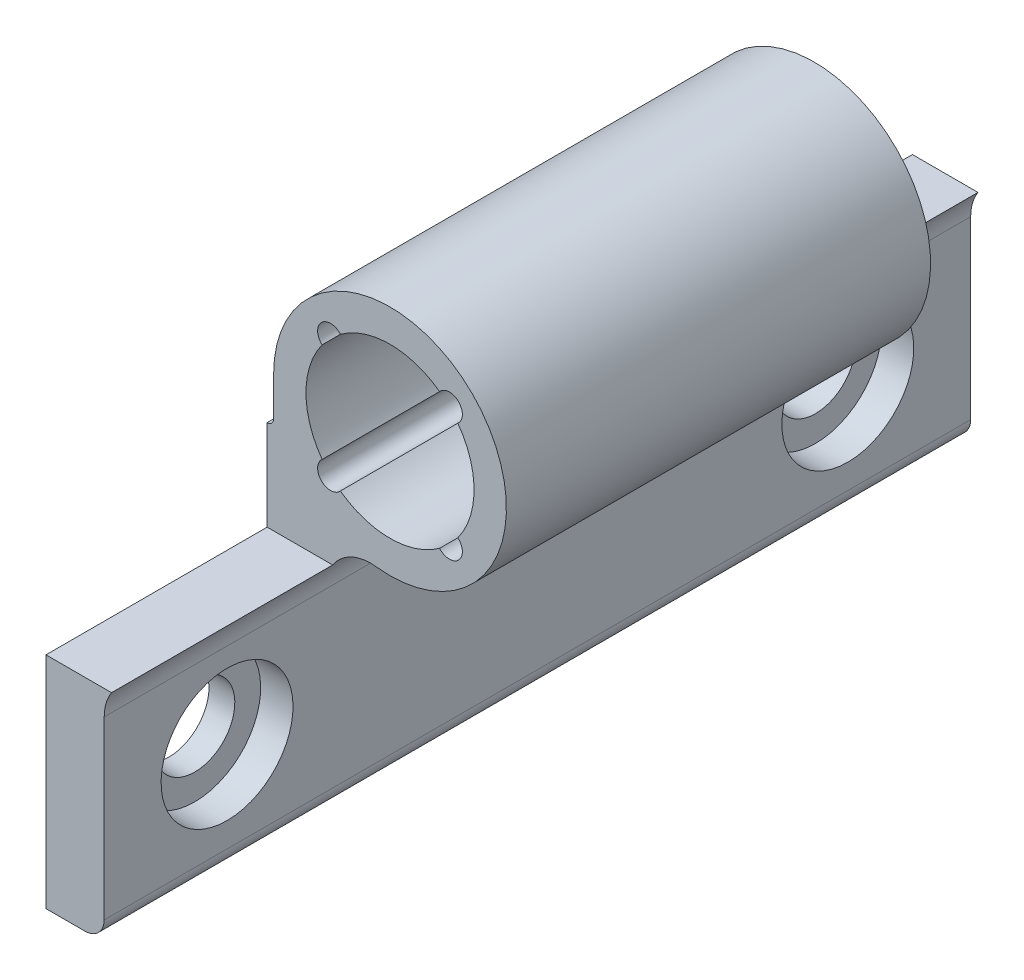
ISO-10303-21;
HEADER;
FILE_DESCRIPTION(('STEP AP214'),'2;1');
FILE_NAME('part.step','',(''),(''),'','','');
FILE_SCHEMA(('AUTOMOTIVE_DESIGN { 1 0 10303 214 1 1 1 1 }'));
ENDSEC;
DATA;
#1=APPLICATION_CONTEXT('core data for automotive mechanical design processes');
#2=APPLICATION_PROTOCOL_DEFINITION('international standard','automotive_design',2000,#1);
#3=PRODUCT_CONTEXT('',#1,'mechanical');
#4=PRODUCT('Part','Part','',(#3));
#5=PRODUCT_RELATED_PRODUCT_CATEGORY('part','',(#4));
#6=PRODUCT_DEFINITION_FORMATION('','',#4);
#7=PRODUCT_DEFINITION_CONTEXT('part definition',#1,'design');
#8=PRODUCT_DEFINITION('design','',#6,#7);
#9=PRODUCT_DEFINITION_SHAPE('','',#8);
#10=(LENGTH_UNIT() NAMED_UNIT(*) SI_UNIT(.MILLI.,.METRE.));
#11=(NAMED_UNIT(*) PLANE_ANGLE_UNIT() SI_UNIT($,.RADIAN.));
#12=(NAMED_UNIT(*) SI_UNIT($,.STERADIAN.) SOLID_ANGLE_UNIT());
#13=UNCERTAINTY_MEASURE_WITH_UNIT(LENGTH_MEASURE(1.E-05),#10,'distance_accuracy_value','');
#14=(GEOMETRIC_REPRESENTATION_CONTEXT(3) GLOBAL_UNCERTAINTY_ASSIGNED_CONTEXT((#13)) GLOBAL_UNIT_ASSIGNED_CONTEXT((#10,
#11,#12)) REPRESENTATION_CONTEXT('',''));
#15=CARTESIAN_POINT('',(0.,0.,0.));
#16=DIRECTION('',(0.,0.,1.));
#17=DIRECTION('',(1.,0.,0.));
#18=AXIS2_PLACEMENT_3D('',#15,#16,#17);
#19=CARTESIAN_POINT('',(-7.5,-22.1,-57.5));
#20=DIRECTION('',(-1.,0.,0.));
#21=DIRECTION('',(0.,-1.,0.));
#22=AXIS2_PLACEMENT_3D('',#19,#20,#21);
#23=PLANE('',#22);
#24=CARTESIAN_POINT('',(-7.5,-19.,-57.5));
#25=DIRECTION('',(-1.,0.,0.));
#26=DIRECTION('',(0.,-1.,0.));
#27=AXIS2_PLACEMENT_3D('',#24,#25,#26);
#28=CIRCLE('',#27,3.10000000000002);
#29=CARTESIAN_POINT('',(-7.5,-22.1,-57.5));
#30=VERTEX_POINT('',#29);
#31=EDGE_CURVE('E19',#30,#30,#28,.T.);
#32=ORIENTED_EDGE('',*,*,#31,.T.);
#33=EDGE_LOOP('',(#32));
#34=FACE_BOUND('',#33,.T.);
#35=CARTESIAN_POINT('',(-7.5,-19.,-57.5));
#36=DIRECTION('',(-1.,0.,0.));
#37=DIRECTION('',(0.,-1.,0.));
#38=AXIS2_PLACEMENT_3D('',#35,#36,#37);
#39=CIRCLE('',#38,5.10000000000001);
#40=CARTESIAN_POINT('',(-7.5,-24.1,-57.5));
#41=VERTEX_POINT('',#40);
#42=EDGE_CURVE('E263',#41,#41,#39,.F.);
#43=ORIENTED_EDGE('',*,*,#42,.T.);
#44=EDGE_LOOP('',(#43));
#45=FACE_BOUND('',#44,.T.);
#46=ADVANCED_FACE('F16',(#34,#45),#23,.F.);
#47=CARTESIAN_POINT('',(-7.5,-22.1,-9.5));
#48=DIRECTION('',(-1.,0.,0.));
#49=DIRECTION('',(0.,-1.,0.));
#50=AXIS2_PLACEMENT_3D('',#47,#48,#49);
#51=PLANE('',#50);
#52=CARTESIAN_POINT('',(-7.5,-19.,-9.5));
#53=DIRECTION('',(-1.,0.,0.));
#54=DIRECTION('',(0.,-1.,0.));
#55=AXIS2_PLACEMENT_3D('',#52,#53,#54);
#56=CIRCLE('',#55,3.10000000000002);
#57=CARTESIAN_POINT('',(-7.5,-22.1,-9.5));
#58=VERTEX_POINT('',#57);
#59=EDGE_CURVE('E265',#58,#58,#56,.T.);
#60=ORIENTED_EDGE('',*,*,#59,.T.);
#61=EDGE_LOOP('',(#60));
#62=FACE_BOUND('',#61,.T.);
#63=CARTESIAN_POINT('',(-7.5,-19.,-9.5));
#64=DIRECTION('',(-1.,0.,0.));
#65=DIRECTION('',(0.,-1.,0.));
#66=AXIS2_PLACEMENT_3D('',#63,#64,#65);
#67=CIRCLE('',#66,5.10000000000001);
#68=CARTESIAN_POINT('',(-7.5,-24.1,-9.5));
#69=VERTEX_POINT('',#68);
#70=EDGE_CURVE('E260',#69,#69,#67,.F.);
#71=ORIENTED_EDGE('',*,*,#70,.T.);
#72=EDGE_LOOP('',(#71));
#73=FACE_BOUND('',#72,.T.);
#74=ADVANCED_FACE('F278',(#62,#73),#51,.F.);
#75=CARTESIAN_POINT('',(-5.,-19.,-57.5));
#76=DIRECTION('',(-1.,0.,0.));
#77=DIRECTION('',(0.,-1.,0.));
#78=AXIS2_PLACEMENT_3D('',#75,#76,#77);
#79=CYLINDRICAL_SURFACE('',#78,3.10000000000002);
#80=ORIENTED_EDGE('',*,*,#31,.F.);
#81=EDGE_LOOP('',(#80));
#82=FACE_BOUND('',#81,.T.);
#83=CARTESIAN_POINT('',(-9.5,-19.,-57.5));
#84=DIRECTION('',(-1.,0.,0.));
#85=DIRECTION('',(0.,-1.,0.));
#86=AXIS2_PLACEMENT_3D('',#83,#84,#85);
#87=CIRCLE('',#86,3.10000000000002);
#88=CARTESIAN_POINT('',(-9.5,-22.1,-57.5));
#89=VERTEX_POINT('',#88);
#90=EDGE_CURVE('E253',#89,#89,#87,.F.);
#91=ORIENTED_EDGE('',*,*,#90,.F.);
#92=EDGE_LOOP('',(#91));
#93=FACE_BOUND('',#92,.T.);
#94=ADVANCED_FACE('F274',(#82,#93),#79,.F.);
#95=CARTESIAN_POINT('',(-5.,-19.,-9.5));
#96=DIRECTION('',(-1.,0.,0.));
#97=DIRECTION('',(0.,-1.,0.));
#98=AXIS2_PLACEMENT_3D('',#95,#96,#97);
#99=CYLINDRICAL_SURFACE('',#98,3.10000000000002);
#100=ORIENTED_EDGE('',*,*,#59,.F.);
#101=EDGE_LOOP('',(#100));
#102=FACE_BOUND('',#101,.T.);
#103=CARTESIAN_POINT('',(-9.5,-19.,-9.5));
#104=DIRECTION('',(-1.,0.,0.));
#105=DIRECTION('',(0.,-1.,0.));
#106=AXIS2_PLACEMENT_3D('',#103,#104,#105);
#107=CIRCLE('',#106,3.10000000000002);
#108=CARTESIAN_POINT('',(-9.5,-22.1,-9.5));
#109=VERTEX_POINT('',#108);
#110=EDGE_CURVE('E249',#109,#109,#107,.F.);
#111=ORIENTED_EDGE('',*,*,#110,.F.);
#112=EDGE_LOOP('',(#111));
#113=FACE_BOUND('',#112,.T.);
#114=ADVANCED_FACE('F277',(#102,#113),#99,.F.);
#115=CARTESIAN_POINT('',(-5.,-19.,-57.5));
#116=DIRECTION('',(-1.,0.,0.));
#117=DIRECTION('',(0.,-1.,0.));
#118=AXIS2_PLACEMENT_3D('',#115,#116,#117);
#119=CYLINDRICAL_SURFACE('',#118,5.10000000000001);
#120=ORIENTED_EDGE('',*,*,#42,.F.);
#121=EDGE_LOOP('',(#120));
#122=FACE_BOUND('',#121,.T.);
#123=CARTESIAN_POINT('',(-5.,-19.,-57.5));
#124=DIRECTION('',(-1.,0.,0.));
#125=DIRECTION('',(0.,-1.,0.));
#126=AXIS2_PLACEMENT_3D('',#123,#124,#125);
#127=CIRCLE('',#126,5.10000000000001);
#128=CARTESIAN_POINT('',(-5.,-24.1,-57.5));
#129=VERTEX_POINT('',#128);
#130=EDGE_CURVE('E241',#129,#129,#127,.T.);
#131=ORIENTED_EDGE('',*,*,#130,.F.);
#132=EDGE_LOOP('',(#131));
#133=FACE_BOUND('',#132,.T.);
#134=ADVANCED_FACE('F477',(#122,#133),#119,.F.);
#135=CARTESIAN_POINT('',(-5.,-19.,-9.5));
#136=DIRECTION('',(-1.,0.,0.));
#137=DIRECTION('',(0.,-1.,0.));
#138=AXIS2_PLACEMENT_3D('',#135,#136,#137);
#139=CYLINDRICAL_SURFACE('',#138,5.10000000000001);
#140=ORIENTED_EDGE('',*,*,#70,.F.);
#141=EDGE_LOOP('',(#140));
#142=FACE_BOUND('',#141,.T.);
#143=CARTESIAN_POINT('',(-5.,-19.,-9.5));
#144=DIRECTION('',(-1.,0.,0.));
#145=DIRECTION('',(0.,-1.,0.));
#146=AXIS2_PLACEMENT_3D('',#143,#144,#145);
#147=CIRCLE('',#146,5.10000000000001);
#148=CARTESIAN_POINT('',(-5.,-24.1,-9.5));
#149=VERTEX_POINT('',#148);
#150=EDGE_CURVE('E238',#149,#149,#147,.T.);
#151=ORIENTED_EDGE('',*,*,#150,.F.);
#152=EDGE_LOOP('',(#151));
#153=FACE_BOUND('',#152,.T.);
#154=ADVANCED_FACE('F473',(#142,#153),#139,.F.);
#155=CARTESIAN_POINT('',(-6.5,-26.,-17.1));
#156=DIRECTION('',(0.,0.,-1.));
#157=DIRECTION('',(-1.,0.,0.));
#158=AXIS2_PLACEMENT_3D('',#155,#156,#157);
#159=CYLINDRICAL_SURFACE('',#158,1.5);
#160=CARTESIAN_POINT('',(-6.5,-26.,-67.));
#161=DIRECTION('',(0.,0.,-1.));
#162=DIRECTION('',(-1.,0.,0.));
#163=AXIS2_PLACEMENT_3D('',#160,#161,#162);
#164=CIRCLE('',#163,1.5);
#165=CARTESIAN_POINT('',(-6.5,-27.5,-67.));
#166=VERTEX_POINT('',#165);
#167=CARTESIAN_POINT('',(-5.,-26.,-67.));
#168=VERTEX_POINT('',#167);
#169=EDGE_CURVE('E245',#166,#168,#164,.F.);
#170=ORIENTED_EDGE('',*,*,#169,.T.);
#171=DIRECTION('',(0.,0.,-1.));
#172=VECTOR('',#171,1.);
#173=CARTESIAN_POINT('',(-5.,-26.,-17.1));
#174=LINE('',#173,#172);
#175=CARTESIAN_POINT('',(-5.,-26.,0.));
#176=VERTEX_POINT('',#175);
#177=EDGE_CURVE('E299',#176,#168,#174,.T.);
#178=ORIENTED_EDGE('',*,*,#177,.F.);
#179=CARTESIAN_POINT('',(-6.5,-26.,0.));
#180=DIRECTION('',(0.,0.,-1.));
#181=DIRECTION('',(-1.,0.,0.));
#182=AXIS2_PLACEMENT_3D('',#179,#180,#181);
#183=CIRCLE('',#182,1.5);
#184=CARTESIAN_POINT('',(-6.5,-27.5,0.));
#185=VERTEX_POINT('',#184);
#186=EDGE_CURVE('E234',#185,#176,#183,.F.);
#187=ORIENTED_EDGE('',*,*,#186,.F.);
#188=DIRECTION('',(0.,0.,1.));
#189=VECTOR('',#188,1.);
#190=CARTESIAN_POINT('',(-6.5,-27.5,-17.1));
#191=LINE('',#190,#189);
#192=EDGE_CURVE('E259',#166,#185,#191,.T.);
#193=ORIENTED_EDGE('',*,*,#192,.F.);
#194=EDGE_LOOP('',(#170,#178,#187,#193));
#195=FACE_BOUND('',#194,.T.);
#196=ADVANCED_FACE('F470',(#195),#159,.T.);
#197=CARTESIAN_POINT('',(-9.5,-27.5,-17.1));
#198=DIRECTION('',(0.,-1.,0.));
#199=DIRECTION('',(1.,0.,0.));
#200=AXIS2_PLACEMENT_3D('',#197,#198,#199);
#201=PLANE('',#200);
#202=DIRECTION('',(1.,0.,0.));
#203=VECTOR('',#202,1.);
#204=CARTESIAN_POINT('',(-6.5,-27.5,-67.));
#205=LINE('',#204,#203);
#206=CARTESIAN_POINT('',(-9.5,-27.5,-67.));
#207=VERTEX_POINT('',#206);
#208=EDGE_CURVE('E248',#207,#166,#205,.T.);
#209=ORIENTED_EDGE('',*,*,#208,.T.);
#210=ORIENTED_EDGE('',*,*,#192,.T.);
#211=DIRECTION('',(1.,0.,0.));
#212=VECTOR('',#211,1.);
#213=CARTESIAN_POINT('',(-6.5,-27.5,0.));
#214=LINE('',#213,#212);
#215=CARTESIAN_POINT('',(-9.5,-27.5,0.));
#216=VERTEX_POINT('',#215);
#217=EDGE_CURVE('E233',#216,#185,#214,.T.);
#218=ORIENTED_EDGE('',*,*,#217,.F.);
#219=DIRECTION('',(0.,0.,1.));
#220=VECTOR('',#219,1.);
#221=CARTESIAN_POINT('',(-9.5,-27.5,-17.1));
#222=LINE('',#221,#220);
#223=EDGE_CURVE('E256',#207,#216,#222,.T.);
#224=ORIENTED_EDGE('',*,*,#223,.F.);
#225=EDGE_LOOP('',(#209,#210,#218,#224));
#226=FACE_BOUND('',#225,.T.);
#227=ADVANCED_FACE('F467',(#226),#201,.T.);
#228=CARTESIAN_POINT('',(-9.5,-3.,-49.9));
#229=DIRECTION('',(0.,0.,-1.));
#230=DIRECTION('',(-1.,0.,0.));
#231=AXIS2_PLACEMENT_3D('',#228,#229,#230);
#232=CYLINDRICAL_SURFACE('',#231,0.500000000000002);
#233=DIRECTION('',(0.,0.,-1.));
#234=VECTOR('',#233,1.);
#235=CARTESIAN_POINT('',(-9.,-3.,-49.9));
#236=LINE('',#235,#234);
#237=CARTESIAN_POINT('',(-9.,-3.,-17.1));
#238=VERTEX_POINT('',#237);
#239=CARTESIAN_POINT('',(-9.,-3.,-49.9));
#240=VERTEX_POINT('',#239);
#241=EDGE_CURVE('E214',#238,#240,#236,.T.);
#242=ORIENTED_EDGE('',*,*,#241,.T.);
#243=CARTESIAN_POINT('',(-9.5,-3.,-49.9));
#244=DIRECTION('',(0.,0.,-1.));
#245=DIRECTION('',(-1.,0.,0.));
#246=AXIS2_PLACEMENT_3D('',#243,#244,#245);
#247=CIRCLE('',#246,0.500000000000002);
#248=CARTESIAN_POINT('',(-9.5,-3.5,-49.9));
#249=VERTEX_POINT('',#248);
#250=EDGE_CURVE('E230',#240,#249,#247,.T.);
#251=ORIENTED_EDGE('',*,*,#250,.T.);
#252=DIRECTION('',(0.,0.,1.));
#253=VECTOR('',#252,1.);
#254=CARTESIAN_POINT('',(-9.5,-3.5,-17.1));
#255=LINE('',#254,#253);
#256=CARTESIAN_POINT('',(-9.5,-3.5,-17.1));
#257=VERTEX_POINT('',#256);
#258=EDGE_CURVE('E258',#257,#249,#255,.F.);
#259=ORIENTED_EDGE('',*,*,#258,.F.);
#260=CARTESIAN_POINT('',(-9.5,-3.,-17.1));
#261=DIRECTION('',(0.,0.,-1.));
#262=DIRECTION('',(-1.,0.,0.));
#263=AXIS2_PLACEMENT_3D('',#260,#261,#262);
#264=CIRCLE('',#263,0.500000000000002);
#265=EDGE_CURVE('E120',#238,#257,#264,.T.);
#266=ORIENTED_EDGE('',*,*,#265,.F.);
#267=EDGE_LOOP('',(#242,#251,#259,#266));
#268=FACE_BOUND('',#267,.T.);
#269=ADVANCED_FACE('F285',(#268),#232,.F.);
#270=CARTESIAN_POINT('',(-9.5,-10.5,-17.1));
#271=DIRECTION('',(-1.,0.,0.));
#272=DIRECTION('',(0.,-1.,0.));
#273=AXIS2_PLACEMENT_3D('',#270,#271,#272);
#274=PLANE('',#273);
#275=ORIENTED_EDGE('',*,*,#110,.T.);
#276=EDGE_LOOP('',(#275));
#277=FACE_BOUND('',#276,.T.);
#278=ORIENTED_EDGE('',*,*,#90,.T.);
#279=EDGE_LOOP('',(#278));
#280=FACE_BOUND('',#279,.T.);
#281=DIRECTION('',(0.,1.,0.));
#282=VECTOR('',#281,1.);
#283=CARTESIAN_POINT('',(-9.5,-26.,-67.));
#284=LINE('',#283,#282);
#285=CARTESIAN_POINT('',(-9.5,-10.5,-67.));
#286=VERTEX_POINT('',#285);
#287=EDGE_CURVE('E291',#286,#207,#284,.F.);
#288=ORIENTED_EDGE('',*,*,#287,.T.);
#289=ORIENTED_EDGE('',*,*,#223,.T.);
#290=DIRECTION('',(0.,1.,0.));
#291=VECTOR('',#290,1.);
#292=CARTESIAN_POINT('',(-9.5,-26.,0.));
#293=LINE('',#292,#291);
#294=CARTESIAN_POINT('',(-9.5,-10.5,0.));
#295=VERTEX_POINT('',#294);
#296=EDGE_CURVE('E341',#295,#216,#293,.F.);
#297=ORIENTED_EDGE('',*,*,#296,.F.);
#298=DIRECTION('',(0.,0.,1.));
#299=VECTOR('',#298,1.);
#300=CARTESIAN_POINT('',(-9.5,-10.5,-17.1));
#301=LINE('',#300,#299);
#302=CARTESIAN_POINT('',(-9.5,-10.5,-17.1));
#303=VERTEX_POINT('',#302);
#304=EDGE_CURVE('E128',#303,#295,#301,.T.);
#305=ORIENTED_EDGE('',*,*,#304,.F.);
#306=DIRECTION('',(0.,1.,0.));
#307=VECTOR('',#306,1.);
#308=CARTESIAN_POINT('',(-9.5,0.,-17.1));
#309=LINE('',#308,#307);
#310=EDGE_CURVE('E174',#257,#303,#309,.F.);
#311=ORIENTED_EDGE('',*,*,#310,.F.);
#312=ORIENTED_EDGE('',*,*,#258,.T.);
#313=DIRECTION('',(0.,1.,0.));
#314=VECTOR('',#313,1.);
#315=CARTESIAN_POINT('',(-9.5,0.,-49.9));
#316=LINE('',#315,#314);
#317=CARTESIAN_POINT('',(-9.5,-10.5,-49.9));
#318=VERTEX_POINT('',#317);
#319=EDGE_CURVE('E232',#249,#318,#316,.F.);
#320=ORIENTED_EDGE('',*,*,#319,.T.);
#321=DIRECTION('',(0.,0.,1.));
#322=VECTOR('',#321,1.);
#323=CARTESIAN_POINT('',(-9.5,-10.5,-67.));
#324=LINE('',#323,#322);
#325=EDGE_CURVE('E295',#318,#286,#324,.F.);
#326=ORIENTED_EDGE('',*,*,#325,.T.);
#327=EDGE_LOOP('',(#288,#289,#297,#305,#311,#312,#320,#326));
#328=FACE_BOUND('',#327,.T.);
#329=ADVANCED_FACE('F282',(#277,#280,#328),#274,.T.);
#330=CARTESIAN_POINT('',(-4.59619407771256,-4.59619407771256,-17.1));
#331=DIRECTION('',(0.,0.,-1.));
#332=DIRECTION('',(-1.,0.,0.));
#333=AXIS2_PLACEMENT_3D('',#330,#331,#332);
#334=CYLINDRICAL_SURFACE('',#333,1.00000000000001);
#335=DIRECTION('',(0.,0.,-1.));
#336=VECTOR('',#335,1.);
#337=CARTESIAN_POINT('',(-5.24681289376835,-3.83678960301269,-17.1));
#338=LINE('',#337,#336);
#339=CARTESIAN_POINT('',(-5.24681289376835,-3.83678960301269,-49.9));
#340=VERTEX_POINT('',#339);
#341=CARTESIAN_POINT('',(-5.24681289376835,-3.83678960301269,-17.1));
#342=VERTEX_POINT('',#341);
#343=EDGE_CURVE('E252',#340,#342,#338,.F.);
#344=ORIENTED_EDGE('',*,*,#343,.T.);
#345=CARTESIAN_POINT('',(-4.59619407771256,-4.59619407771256,-17.1));
#346=DIRECTION('',(0.,0.,-1.));
#347=DIRECTION('',(-1.,0.,0.));
#348=AXIS2_PLACEMENT_3D('',#345,#346,#347);
#349=CIRCLE('',#348,1.00000000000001);
#350=CARTESIAN_POINT('',(-3.83678960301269,-5.24681289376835,-17.1));
#351=VERTEX_POINT('',#350);
#352=EDGE_CURVE('E208',#351,#342,#349,.T.);
#353=ORIENTED_EDGE('',*,*,#352,.F.);
#354=DIRECTION('',(0.,0.,-1.));
#355=VECTOR('',#354,1.);
#356=CARTESIAN_POINT('',(-3.83678960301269,-5.24681289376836,-17.1));
#357=LINE('',#356,#355);
#358=CARTESIAN_POINT('',(-3.83678960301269,-5.24681289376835,-49.9));
#359=VERTEX_POINT('',#358);
#360=EDGE_CURVE('E319',#351,#359,#357,.T.);
#361=ORIENTED_EDGE('',*,*,#360,.T.);
#362=CARTESIAN_POINT('',(-4.59619407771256,-4.59619407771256,-49.9));
#363=DIRECTION('',(0.,0.,-1.));
#364=DIRECTION('',(-1.,0.,0.));
#365=AXIS2_PLACEMENT_3D('',#362,#363,#364);
#366=CIRCLE('',#365,1.00000000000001);
#367=EDGE_CURVE('E215',#359,#340,#366,.T.);
#368=ORIENTED_EDGE('',*,*,#367,.T.);
#369=EDGE_LOOP('',(#344,#353,#361,#368));
#370=FACE_BOUND('',#369,.T.);
#371=ADVANCED_FACE('F284',(#370),#334,.F.);
#372=CARTESIAN_POINT('',(0.,0.,-17.1));
#373=DIRECTION('',(0.,0.,-1.));
#374=DIRECTION('',(-1.,0.,0.));
#375=AXIS2_PLACEMENT_3D('',#372,#373,#374);
#376=CYLINDRICAL_SURFACE('',#375,6.50000000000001);
#377=ORIENTED_EDGE('',*,*,#343,.F.);
#378=CARTESIAN_POINT('',(0.,0.,-49.9));
#379=DIRECTION('',(0.,0.,-1.));
#380=DIRECTION('',(-1.,0.,0.));
#381=AXIS2_PLACEMENT_3D('',#378,#379,#380);
#382=CIRCLE('',#381,6.50000000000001);
#383=CARTESIAN_POINT('',(-5.24681289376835,3.83678960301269,-49.9));
#384=VERTEX_POINT('',#383);
#385=EDGE_CURVE('E211',#340,#384,#382,.T.);
#386=ORIENTED_EDGE('',*,*,#385,.T.);
#387=DIRECTION('',(0.,0.,-1.));
#388=VECTOR('',#387,1.);
#389=CARTESIAN_POINT('',(-5.24681289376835,3.83678960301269,-17.1));
#390=LINE('',#389,#388);
#391=CARTESIAN_POINT('',(-5.24681289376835,3.83678960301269,-17.1));
#392=VERTEX_POINT('',#391);
#393=EDGE_CURVE('E329',#384,#392,#390,.F.);
#394=ORIENTED_EDGE('',*,*,#393,.T.);
#395=CARTESIAN_POINT('',(0.,0.,-17.1));
#396=DIRECTION('',(0.,0.,-1.));
#397=DIRECTION('',(-1.,0.,0.));
#398=AXIS2_PLACEMENT_3D('',#395,#396,#397);
#399=CIRCLE('',#398,6.50000000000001);
#400=EDGE_CURVE('E205',#342,#392,#399,.T.);
#401=ORIENTED_EDGE('',*,*,#400,.F.);
#402=EDGE_LOOP('',(#377,#386,#394,#401));
#403=FACE_BOUND('',#402,.T.);
#404=ADVANCED_FACE('F457',(#403),#376,.F.);
#405=CARTESIAN_POINT('',(-4.59619407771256,4.59619407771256,-17.1));
#406=DIRECTION('',(0.,0.,-1.));
#407=DIRECTION('',(-1.,0.,0.));
#408=AXIS2_PLACEMENT_3D('',#405,#406,#407);
#409=CYLINDRICAL_SURFACE('',#408,1.00000000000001);
#410=DIRECTION('',(0.,0.,-1.));
#411=VECTOR('',#410,1.);
#412=CARTESIAN_POINT('',(-3.83678960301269,5.24681289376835,-17.1));
#413=LINE('',#412,#411);
#414=CARTESIAN_POINT('',(-3.83678960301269,5.24681289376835,-49.9));
#415=VERTEX_POINT('',#414);
#416=CARTESIAN_POINT('',(-3.83678960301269,5.24681289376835,-17.1));
#417=VERTEX_POINT('',#416);
#418=EDGE_CURVE('E327',#415,#417,#413,.F.);
#419=ORIENTED_EDGE('',*,*,#418,.T.);
#420=CARTESIAN_POINT('',(-4.59619407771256,4.59619407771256,-17.1));
#421=DIRECTION('',(0.,0.,-1.));
#422=DIRECTION('',(-1.,0.,0.));
#423=AXIS2_PLACEMENT_3D('',#420,#421,#422);
#424=CIRCLE('',#423,1.00000000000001);
#425=EDGE_CURVE('E202',#392,#417,#424,.T.);
#426=ORIENTED_EDGE('',*,*,#425,.F.);
#427=ORIENTED_EDGE('',*,*,#393,.F.);
#428=CARTESIAN_POINT('',(-4.59619407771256,4.59619407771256,-49.9));
#429=DIRECTION('',(0.,0.,-1.));
#430=DIRECTION('',(-1.,0.,0.));
#431=AXIS2_PLACEMENT_3D('',#428,#429,#430);
#432=CIRCLE('',#431,1.00000000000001);
#433=EDGE_CURVE('E228',#384,#415,#432,.T.);
#434=ORIENTED_EDGE('',*,*,#433,.T.);
#435=EDGE_LOOP('',(#419,#426,#427,#434));
#436=FACE_BOUND('',#435,.T.);
#437=ADVANCED_FACE('F453',(#436),#409,.F.);
#438=CARTESIAN_POINT('',(0.,0.,-17.1));
#439=DIRECTION('',(0.,0.,-1.));
#440=DIRECTION('',(-1.,0.,0.));
#441=AXIS2_PLACEMENT_3D('',#438,#439,#440);
#442=CYLINDRICAL_SURFACE('',#441,6.50000000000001);
#443=DIRECTION('',(0.,0.,-1.));
#444=VECTOR('',#443,1.);
#445=CARTESIAN_POINT('',(3.83678960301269,5.24681289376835,-17.1));
#446=LINE('',#445,#444);
#447=CARTESIAN_POINT('',(3.83678960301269,5.24681289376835,-49.9));
#448=VERTEX_POINT('',#447);
#449=CARTESIAN_POINT('',(3.83678960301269,5.24681289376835,-17.1));
#450=VERTEX_POINT('',#449);
#451=EDGE_CURVE('E325',#448,#450,#446,.F.);
#452=ORIENTED_EDGE('',*,*,#451,.T.);
#453=CARTESIAN_POINT('',(0.,0.,-17.1));
#454=DIRECTION('',(0.,0.,-1.));
#455=DIRECTION('',(-1.,0.,0.));
#456=AXIS2_PLACEMENT_3D('',#453,#454,#455);
#457=CIRCLE('',#456,6.50000000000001);
#458=EDGE_CURVE('E199',#417,#450,#457,.T.);
#459=ORIENTED_EDGE('',*,*,#458,.F.);
#460=ORIENTED_EDGE('',*,*,#418,.F.);
#461=CARTESIAN_POINT('',(0.,0.,-49.9));
#462=DIRECTION('',(0.,0.,-1.));
#463=DIRECTION('',(-1.,0.,0.));
#464=AXIS2_PLACEMENT_3D('',#461,#462,#463);
#465=CIRCLE('',#464,6.50000000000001);
#466=EDGE_CURVE('E226',#415,#448,#465,.T.);
#467=ORIENTED_EDGE('',*,*,#466,.T.);
#468=EDGE_LOOP('',(#452,#459,#460,#467));
#469=FACE_BOUND('',#468,.T.);
#470=ADVANCED_FACE('F449',(#469),#442,.F.);
#471=CARTESIAN_POINT('',(4.59619407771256,4.59619407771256,-17.1));
#472=DIRECTION('',(0.,0.,-1.));
#473=DIRECTION('',(-1.,0.,0.));
#474=AXIS2_PLACEMENT_3D('',#471,#472,#473);
#475=CYLINDRICAL_SURFACE('',#474,1.00000000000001);
#476=DIRECTION('',(0.,0.,-1.));
#477=VECTOR('',#476,1.);
#478=CARTESIAN_POINT('',(5.24681289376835,3.83678960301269,-17.1));
#479=LINE('',#478,#477);
#480=CARTESIAN_POINT('',(5.24681289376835,3.83678960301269,-49.9));
#481=VERTEX_POINT('',#480);
#482=CARTESIAN_POINT('',(5.24681289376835,3.83678960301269,-17.1));
#483=VERTEX_POINT('',#482);
#484=EDGE_CURVE('E323',#481,#483,#479,.F.);
#485=ORIENTED_EDGE('',*,*,#484,.T.);
#486=CARTESIAN_POINT('',(4.59619407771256,4.59619407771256,-17.1));
#487=DIRECTION('',(0.,0.,-1.));
#488=DIRECTION('',(-1.,0.,0.));
#489=AXIS2_PLACEMENT_3D('',#486,#487,#488);
#490=CIRCLE('',#489,1.00000000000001);
#491=EDGE_CURVE('E196',#450,#483,#490,.T.);
#492=ORIENTED_EDGE('',*,*,#491,.F.);
#493=ORIENTED_EDGE('',*,*,#451,.F.);
#494=CARTESIAN_POINT('',(4.59619407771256,4.59619407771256,-49.9));
#495=DIRECTION('',(0.,0.,-1.));
#496=DIRECTION('',(-1.,0.,0.));
#497=AXIS2_PLACEMENT_3D('',#494,#495,#496);
#498=CIRCLE('',#497,1.00000000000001);
#499=EDGE_CURVE('E224',#448,#481,#498,.T.);
#500=ORIENTED_EDGE('',*,*,#499,.T.);
#501=EDGE_LOOP('',(#485,#492,#493,#500));
#502=FACE_BOUND('',#501,.T.);
#503=ADVANCED_FACE('F445',(#502),#475,.F.);
#504=CARTESIAN_POINT('',(0.,0.,-17.1));
#505=DIRECTION('',(0.,0.,-1.));
#506=DIRECTION('',(-1.,0.,0.));
#507=AXIS2_PLACEMENT_3D('',#504,#505,#506);
#508=CYLINDRICAL_SURFACE('',#507,6.50000000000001);
#509=DIRECTION('',(0.,0.,-1.));
#510=VECTOR('',#509,1.);
#511=CARTESIAN_POINT('',(5.24681289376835,-3.83678960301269,-17.1));
#512=LINE('',#511,#510);
#513=CARTESIAN_POINT('',(5.24681289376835,-3.83678960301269,-49.9));
#514=VERTEX_POINT('',#513);
#515=CARTESIAN_POINT('',(5.24681289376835,-3.83678960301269,-17.1));
#516=VERTEX_POINT('',#515);
#517=EDGE_CURVE('E320',#514,#516,#512,.F.);
#518=ORIENTED_EDGE('',*,*,#517,.T.);
#519=CARTESIAN_POINT('',(0.,0.,-17.1));
#520=DIRECTION('',(0.,0.,-1.));
#521=DIRECTION('',(-1.,0.,0.));
#522=AXIS2_PLACEMENT_3D('',#519,#520,#521);
#523=CIRCLE('',#522,6.50000000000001);
#524=EDGE_CURVE('E193',#483,#516,#523,.T.);
#525=ORIENTED_EDGE('',*,*,#524,.F.);
#526=ORIENTED_EDGE('',*,*,#484,.F.);
#527=CARTESIAN_POINT('',(0.,0.,-49.9));
#528=DIRECTION('',(0.,0.,-1.));
#529=DIRECTION('',(-1.,0.,0.));
#530=AXIS2_PLACEMENT_3D('',#527,#528,#529);
#531=CIRCLE('',#530,6.50000000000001);
#532=EDGE_CURVE('E222',#481,#514,#531,.T.);
#533=ORIENTED_EDGE('',*,*,#532,.T.);
#534=EDGE_LOOP('',(#518,#525,#526,#533));
#535=FACE_BOUND('',#534,.T.);
#536=ADVANCED_FACE('F441',(#535),#508,.F.);
#537=CARTESIAN_POINT('',(4.59619407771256,-4.59619407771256,-17.1));
#538=DIRECTION('',(0.,0.,-1.));
#539=DIRECTION('',(-1.,0.,0.));
#540=AXIS2_PLACEMENT_3D('',#537,#538,#539);
#541=CYLINDRICAL_SURFACE('',#540,1.00000000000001);
#542=DIRECTION('',(0.,0.,-1.));
#543=VECTOR('',#542,1.);
#544=CARTESIAN_POINT('',(3.83678960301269,-5.24681289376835,-17.1));
#545=LINE('',#544,#543);
#546=CARTESIAN_POINT('',(3.83678960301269,-5.24681289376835,-49.9));
#547=VERTEX_POINT('',#546);
#548=CARTESIAN_POINT('',(3.83678960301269,-5.24681289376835,-17.1));
#549=VERTEX_POINT('',#548);
#550=EDGE_CURVE('E317',#547,#549,#545,.F.);
#551=ORIENTED_EDGE('',*,*,#550,.T.);
#552=CARTESIAN_POINT('',(4.59619407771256,-4.59619407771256,-17.1));
#553=DIRECTION('',(0.,0.,-1.));
#554=DIRECTION('',(-1.,0.,0.));
#555=AXIS2_PLACEMENT_3D('',#552,#553,#554);
#556=CIRCLE('',#555,1.00000000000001);
#557=EDGE_CURVE('E190',#516,#549,#556,.T.);
#558=ORIENTED_EDGE('',*,*,#557,.F.);
#559=ORIENTED_EDGE('',*,*,#517,.F.);
#560=CARTESIAN_POINT('',(4.59619407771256,-4.59619407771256,-49.9));
#561=DIRECTION('',(0.,0.,-1.));
#562=DIRECTION('',(-1.,0.,0.));
#563=AXIS2_PLACEMENT_3D('',#560,#561,#562);
#564=CIRCLE('',#563,1.00000000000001);
#565=EDGE_CURVE('E220',#514,#547,#564,.T.);
#566=ORIENTED_EDGE('',*,*,#565,.T.);
#567=EDGE_LOOP('',(#551,#558,#559,#566));
#568=FACE_BOUND('',#567,.T.);
#569=ADVANCED_FACE('F437',(#568),#541,.F.);
#570=CARTESIAN_POINT('',(0.,0.,-17.1));
#571=DIRECTION('',(0.,0.,-1.));
#572=DIRECTION('',(-1.,0.,0.));
#573=AXIS2_PLACEMENT_3D('',#570,#571,#572);
#574=CYLINDRICAL_SURFACE('',#573,6.50000000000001);
#575=ORIENTED_EDGE('',*,*,#360,.F.);
#576=CARTESIAN_POINT('',(0.,0.,-17.1));
#577=DIRECTION('',(0.,0.,-1.));
#578=DIRECTION('',(-1.,0.,0.));
#579=AXIS2_PLACEMENT_3D('',#576,#577,#578);
#580=CIRCLE('',#579,6.50000000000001);
#581=EDGE_CURVE('E171',#549,#351,#580,.T.);
#582=ORIENTED_EDGE('',*,*,#581,.F.);
#583=ORIENTED_EDGE('',*,*,#550,.F.);
#584=CARTESIAN_POINT('',(0.,0.,-49.9));
#585=DIRECTION('',(0.,0.,-1.));
#586=DIRECTION('',(-1.,0.,0.));
#587=AXIS2_PLACEMENT_3D('',#584,#585,#586);
#588=CIRCLE('',#587,6.50000000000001);
#589=EDGE_CURVE('E217',#547,#359,#588,.T.);
#590=ORIENTED_EDGE('',*,*,#589,.T.);
#591=EDGE_LOOP('',(#575,#582,#583,#590));
#592=FACE_BOUND('',#591,.T.);
#593=ADVANCED_FACE('F434',(#592),#574,.F.);
#594=CARTESIAN_POINT('',(-4.43311209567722,-10.5,-17.1));
#595=DIRECTION('',(0.,1.,0.));
#596=DIRECTION('',(0.,0.,1.));
#597=AXIS2_PLACEMENT_3D('',#594,#595,#596);
#598=PLANE('',#597);
#599=DIRECTION('',(1.,0.,0.));
#600=VECTOR('',#599,1.);
#601=CARTESIAN_POINT('',(0.,-10.5,-17.1));
#602=LINE('',#601,#600);
#603=CARTESIAN_POINT('',(-4.43311209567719,-10.5,-17.1));
#604=VERTEX_POINT('',#603);
#605=EDGE_CURVE('E164',#303,#604,#602,.T.);
#606=ORIENTED_EDGE('',*,*,#605,.F.);
#607=ORIENTED_EDGE('',*,*,#304,.T.);
#608=DIRECTION('',(1.,0.,0.));
#609=VECTOR('',#608,1.);
#610=CARTESIAN_POINT('',(-6.5,-10.5,0.));
#611=LINE('',#610,#609);
#612=CARTESIAN_POINT('',(-4.43311209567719,-10.5,0.));
#613=VERTEX_POINT('',#612);
#614=EDGE_CURVE('E167',#613,#295,#611,.F.);
#615=ORIENTED_EDGE('',*,*,#614,.F.);
#616=DIRECTION('',(0.,0.,-1.));
#617=VECTOR('',#616,1.);
#618=CARTESIAN_POINT('',(-4.4331120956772,-10.5,-17.1));
#619=LINE('',#618,#617);
#620=EDGE_CURVE('E162',#613,#604,#619,.T.);
#621=ORIENTED_EDGE('',*,*,#620,.T.);
#622=EDGE_LOOP('',(#606,#607,#615,#621));
#623=FACE_BOUND('',#622,.T.);
#624=ADVANCED_FACE('F163',(#623),#598,.T.);
#625=CARTESIAN_POINT('',(-4.43311209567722,-10.5,-67.));
#626=DIRECTION('',(0.,-1.,0.));
#627=DIRECTION('',(1.,0.,0.));
#628=AXIS2_PLACEMENT_3D('',#625,#626,#627);
#629=PLANE('',#628);
#630=DIRECTION('',(0.,0.,-1.));
#631=VECTOR('',#630,1.);
#632=CARTESIAN_POINT('',(-4.4331120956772,-10.5,-17.1));
#633=LINE('',#632,#631);
#634=CARTESIAN_POINT('',(-4.43311209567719,-10.5,-49.9));
#635=VERTEX_POINT('',#634);
#636=CARTESIAN_POINT('',(-4.43311209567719,-10.5,-67.));
#637=VERTEX_POINT('',#636);
#638=EDGE_CURVE('E184',#635,#637,#633,.T.);
#639=ORIENTED_EDGE('',*,*,#638,.T.);
#640=DIRECTION('',(1.,0.,0.));
#641=VECTOR('',#640,1.);
#642=CARTESIAN_POINT('',(-6.5,-10.5,-67.));
#643=LINE('',#642,#641);
#644=EDGE_CURVE('E247',#637,#286,#643,.F.);
#645=ORIENTED_EDGE('',*,*,#644,.T.);
#646=ORIENTED_EDGE('',*,*,#325,.F.);
#647=DIRECTION('',(1.,0.,0.));
#648=VECTOR('',#647,1.);
#649=CARTESIAN_POINT('',(0.,-10.5,-49.9));
#650=LINE('',#649,#648);
#651=EDGE_CURVE('E157',#318,#635,#650,.T.);
#652=ORIENTED_EDGE('',*,*,#651,.T.);
#653=EDGE_LOOP('',(#639,#645,#646,#652));
#654=FACE_BOUND('',#653,.T.);
#655=ADVANCED_FACE('F369',(#654),#629,.F.);
#656=CARTESIAN_POINT('',(-6.5,-26.,-67.));
#657=DIRECTION('',(0.,0.,1.));
#658=DIRECTION('',(1.,0.,0.));
#659=AXIS2_PLACEMENT_3D('',#656,#657,#658);
#660=PLANE('',#659);
#661=ORIENTED_EDGE('',*,*,#644,.F.);
#662=CARTESIAN_POINT('',(-1.5,-12.4096736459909,-67.));
#663=DIRECTION('',(0.,0.,-1.));
#664=DIRECTION('',(-1.,0.,0.));
#665=AXIS2_PLACEMENT_3D('',#662,#663,#664);
#666=CIRCLE('',#665,3.5);
#667=CARTESIAN_POINT('',(-5.,-12.4096736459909,-67.));
#668=VERTEX_POINT('',#667);
#669=EDGE_CURVE('E316',#637,#668,#666,.F.);
#670=ORIENTED_EDGE('',*,*,#669,.T.);
#671=DIRECTION('',(0.,1.,0.));
#672=VECTOR('',#671,1.);
#673=CARTESIAN_POINT('',(-5.,-26.,-67.));
#674=LINE('',#673,#672);
#675=EDGE_CURVE('E244',#168,#668,#674,.T.);
#676=ORIENTED_EDGE('',*,*,#675,.F.);
#677=ORIENTED_EDGE('',*,*,#169,.F.);
#678=ORIENTED_EDGE('',*,*,#208,.F.);
#679=ORIENTED_EDGE('',*,*,#287,.F.);
#680=EDGE_LOOP('',(#661,#670,#676,#677,#678,#679));
#681=FACE_BOUND('',#680,.T.);
#682=ADVANCED_FACE('F303',(#681),#660,.F.);
#683=CARTESIAN_POINT('',(-5.,-26.,-17.1));
#684=DIRECTION('',(1.,0.,0.));
#685=DIRECTION('',(0.,0.,-1.));
#686=AXIS2_PLACEMENT_3D('',#683,#684,#685);
#687=PLANE('',#686);
#688=ORIENTED_EDGE('',*,*,#150,.T.);
#689=EDGE_LOOP('',(#688));
#690=FACE_BOUND('',#689,.T.);
#691=ORIENTED_EDGE('',*,*,#130,.T.);
#692=EDGE_LOOP('',(#691));
#693=FACE_BOUND('',#692,.T.);
#694=ORIENTED_EDGE('',*,*,#675,.T.);
#695=DIRECTION('',(0.,0.,-1.));
#696=VECTOR('',#695,1.);
#697=CARTESIAN_POINT('',(-5.,-12.4096736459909,-17.1));
#698=LINE('',#697,#696);
#699=CARTESIAN_POINT('',(-5.,-12.4096736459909,0.));
#700=VERTEX_POINT('',#699);
#701=EDGE_CURVE('E359',#668,#700,#698,.F.);
#702=ORIENTED_EDGE('',*,*,#701,.T.);
#703=DIRECTION('',(0.,1.,0.));
#704=VECTOR('',#703,1.);
#705=CARTESIAN_POINT('',(-5.,-26.,0.));
#706=LINE('',#705,#704);
#707=EDGE_CURVE('E237',#176,#700,#706,.T.);
#708=ORIENTED_EDGE('',*,*,#707,.F.);
#709=ORIENTED_EDGE('',*,*,#177,.T.);
#710=EDGE_LOOP('',(#694,#702,#708,#709));
#711=FACE_BOUND('',#710,.T.);
#712=ADVANCED_FACE('F424',(#690,#693,#711),#687,.T.);
#713=CARTESIAN_POINT('',(-6.5,-26.,0.));
#714=DIRECTION('',(0.,0.,1.));
#715=DIRECTION('',(1.,0.,0.));
#716=AXIS2_PLACEMENT_3D('',#713,#714,#715);
#717=PLANE('',#716);
#718=ORIENTED_EDGE('',*,*,#296,.T.);
#719=ORIENTED_EDGE('',*,*,#217,.T.);
#720=ORIENTED_EDGE('',*,*,#186,.T.);
#721=ORIENTED_EDGE('',*,*,#707,.T.);
#722=CARTESIAN_POINT('',(-1.5,-12.4096736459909,0.));
#723=DIRECTION('',(0.,0.,-1.));
#724=DIRECTION('',(-1.,0.,0.));
#725=AXIS2_PLACEMENT_3D('',#722,#723,#724);
#726=CIRCLE('',#725,3.5);
#727=EDGE_CURVE('E358',#700,#613,#726,.T.);
#728=ORIENTED_EDGE('',*,*,#727,.T.);
#729=ORIENTED_EDGE('',*,*,#614,.T.);
#730=EDGE_LOOP('',(#718,#719,#720,#721,#728,#729));
#731=FACE_BOUND('',#730,.T.);
#732=ADVANCED_FACE('F373',(#731),#717,.T.);
#733=CARTESIAN_POINT('',(0.,0.,-49.9));
#734=DIRECTION('',(0.,0.,1.));
#735=DIRECTION('',(1.,0.,0.));
#736=AXIS2_PLACEMENT_3D('',#733,#734,#735);
#737=PLANE('',#736);
#738=ORIENTED_EDGE('',*,*,#367,.F.);
#739=ORIENTED_EDGE('',*,*,#589,.F.);
#740=ORIENTED_EDGE('',*,*,#565,.F.);
#741=ORIENTED_EDGE('',*,*,#532,.F.);
#742=ORIENTED_EDGE('',*,*,#499,.F.);
#743=ORIENTED_EDGE('',*,*,#466,.F.);
#744=ORIENTED_EDGE('',*,*,#433,.F.);
#745=ORIENTED_EDGE('',*,*,#385,.F.);
#746=EDGE_LOOP('',(#738,#739,#740,#741,#742,#743,#744,#745));
#747=FACE_BOUND('',#746,.T.);
#748=ORIENTED_EDGE('',*,*,#319,.F.);
#749=ORIENTED_EDGE('',*,*,#250,.F.);
#750=DIRECTION('',(0.,1.,0.));
#751=VECTOR('',#750,1.);
#752=CARTESIAN_POINT('',(-9.,0.,-49.9));
#753=LINE('',#752,#751);
#754=CARTESIAN_POINT('',(-9.,0.,-49.9));
#755=VERTEX_POINT('',#754);
#756=EDGE_CURVE('E176',#240,#755,#753,.T.);
#757=ORIENTED_EDGE('',*,*,#756,.T.);
#758=CARTESIAN_POINT('',(0.,0.,-49.9));
#759=DIRECTION('',(0.,0.,-1.));
#760=DIRECTION('',(-1.,0.,0.));
#761=AXIS2_PLACEMENT_3D('',#758,#759,#760);
#762=CIRCLE('',#761,9.);
#763=CARTESIAN_POINT('',(-1.08,-8.93496502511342,-49.9));
#764=VERTEX_POINT('',#763);
#765=EDGE_CURVE('E355',#764,#755,#762,.F.);
#766=ORIENTED_EDGE('',*,*,#765,.F.);
#767=CARTESIAN_POINT('',(-1.5,-12.4096736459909,-49.9));
#768=DIRECTION('',(0.,0.,-1.));
#769=DIRECTION('',(-1.,0.,0.));
#770=AXIS2_PLACEMENT_3D('',#767,#768,#769);
#771=CIRCLE('',#770,3.5);
#772=EDGE_CURVE('E182',#764,#635,#771,.F.);
#773=ORIENTED_EDGE('',*,*,#772,.T.);
#774=ORIENTED_EDGE('',*,*,#651,.F.);
#775=EDGE_LOOP('',(#748,#749,#757,#766,#773,#774));
#776=FACE_BOUND('',#775,.T.);
#777=ADVANCED_FACE('F403',(#747,#776),#737,.F.);
#778=CARTESIAN_POINT('',(-9.,0.,-49.9));
#779=DIRECTION('',(1.,0.,0.));
#780=DIRECTION('',(0.,0.,-1.));
#781=AXIS2_PLACEMENT_3D('',#778,#779,#780);
#782=PLANE('',#781);
#783=DIRECTION('',(0.,0.,-1.));
#784=VECTOR('',#783,1.);
#785=CARTESIAN_POINT('',(-9.,0.,-49.9));
#786=LINE('',#785,#784);
#787=CARTESIAN_POINT('',(-9.,0.,-17.1));
#788=VERTEX_POINT('',#787);
#789=EDGE_CURVE('E354',#755,#788,#786,.F.);
#790=ORIENTED_EDGE('',*,*,#789,.F.);
#791=ORIENTED_EDGE('',*,*,#756,.F.);
#792=ORIENTED_EDGE('',*,*,#241,.F.);
#793=DIRECTION('',(0.,1.,0.));
#794=VECTOR('',#793,1.);
#795=CARTESIAN_POINT('',(-9.,0.,-17.1));
#796=LINE('',#795,#794);
#797=EDGE_CURVE('E175',#788,#238,#796,.F.);
#798=ORIENTED_EDGE('',*,*,#797,.F.);
#799=EDGE_LOOP('',(#790,#791,#792,#798));
#800=FACE_BOUND('',#799,.T.);
#801=ADVANCED_FACE('F398',(#800),#782,.F.);
#802=CARTESIAN_POINT('',(0.,0.,-17.1));
#803=DIRECTION('',(0.,0.,1.));
#804=DIRECTION('',(1.,0.,0.));
#805=AXIS2_PLACEMENT_3D('',#802,#803,#804);
#806=PLANE('',#805);
#807=ORIENTED_EDGE('',*,*,#557,.T.);
#808=ORIENTED_EDGE('',*,*,#581,.T.);
#809=ORIENTED_EDGE('',*,*,#352,.T.);
#810=ORIENTED_EDGE('',*,*,#400,.T.);
#811=ORIENTED_EDGE('',*,*,#425,.T.);
#812=ORIENTED_EDGE('',*,*,#458,.T.);
#813=ORIENTED_EDGE('',*,*,#491,.T.);
#814=ORIENTED_EDGE('',*,*,#524,.T.);
#815=EDGE_LOOP('',(#807,#808,#809,#810,#811,#812,#813,#814));
#816=FACE_BOUND('',#815,.T.);
#817=ORIENTED_EDGE('',*,*,#265,.T.);
#818=ORIENTED_EDGE('',*,*,#310,.T.);
#819=ORIENTED_EDGE('',*,*,#605,.T.);
#820=CARTESIAN_POINT('',(-1.5,-12.4096736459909,-17.1));
#821=DIRECTION('',(0.,0.,-1.));
#822=DIRECTION('',(-1.,0.,0.));
#823=AXIS2_PLACEMENT_3D('',#820,#821,#822);
#824=CIRCLE('',#823,3.5);
#825=CARTESIAN_POINT('',(-1.08,-8.93496502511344,-17.1));
#826=VERTEX_POINT('',#825);
#827=EDGE_CURVE('E34',#604,#826,#824,.T.);
#828=ORIENTED_EDGE('',*,*,#827,.T.);
#829=CARTESIAN_POINT('',(0.,0.,-17.1));
#830=DIRECTION('',(0.,0.,-1.));
#831=DIRECTION('',(-1.,0.,0.));
#832=AXIS2_PLACEMENT_3D('',#829,#830,#831);
#833=CIRCLE('',#832,9.);
#834=EDGE_CURVE('E25',#788,#826,#833,.T.);
#835=ORIENTED_EDGE('',*,*,#834,.F.);
#836=ORIENTED_EDGE('',*,*,#797,.T.);
#837=EDGE_LOOP('',(#817,#818,#819,#828,#835,#836));
#838=FACE_BOUND('',#837,.T.);
#839=ADVANCED_FACE('F173',(#816,#838),#806,.T.);
#840=CARTESIAN_POINT('',(-1.5,-12.4096736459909,-17.1));
#841=DIRECTION('',(0.,0.,-1.));
#842=DIRECTION('',(-1.,0.,0.));
#843=AXIS2_PLACEMENT_3D('',#840,#841,#842);
#844=CYLINDRICAL_SURFACE('',#843,3.5);
#845=ORIENTED_EDGE('',*,*,#701,.F.);
#846=ORIENTED_EDGE('',*,*,#669,.F.);
#847=ORIENTED_EDGE('',*,*,#638,.F.);
#848=ORIENTED_EDGE('',*,*,#772,.F.);
#849=DIRECTION('',(0.,0.,-1.));
#850=VECTOR('',#849,1.);
#851=CARTESIAN_POINT('',(-1.08,-8.93496502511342,-49.9));
#852=LINE('',#851,#850);
#853=EDGE_CURVE('E10',#826,#764,#852,.T.);
#854=ORIENTED_EDGE('',*,*,#853,.F.);
#855=ORIENTED_EDGE('',*,*,#827,.F.);
#856=ORIENTED_EDGE('',*,*,#620,.F.);
#857=ORIENTED_EDGE('',*,*,#727,.F.);
#858=EDGE_LOOP('',(#845,#846,#847,#848,#854,#855,#856,#857));
#859=FACE_BOUND('',#858,.T.);
#860=ADVANCED_FACE('F179',(#859),#844,.F.);
#861=CARTESIAN_POINT('',(0.,0.,-49.9));
#862=DIRECTION('',(0.,0.,-1.));
#863=DIRECTION('',(-1.,0.,0.));
#864=AXIS2_PLACEMENT_3D('',#861,#862,#863);
#865=CYLINDRICAL_SURFACE('',#864,9.);
#866=ORIENTED_EDGE('',*,*,#834,.T.);
#867=ORIENTED_EDGE('',*,*,#853,.T.);
#868=ORIENTED_EDGE('',*,*,#765,.T.);
#869=ORIENTED_EDGE('',*,*,#789,.T.);
#870=EDGE_LOOP('',(#866,#867,#868,#869));
#871=FACE_BOUND('',#870,.T.);
#872=ADVANCED_FACE('F405',(#871),#865,.T.);
#873=CLOSED_SHELL('',(#46,#74,#94,#114,#134,#154,#196,#227,#269,#329,#371,#404,#437,#470,#503,
#536,#569,#593,#624,#655,#682,#712,#732,#777,#801,#839,#860,#872));
#874=MANIFOLD_SOLID_BREP('B1',#873);
#875=ADVANCED_BREP_SHAPE_REPRESENTATION('',(#18,#874),#14);
#876=SHAPE_DEFINITION_REPRESENTATION(#9,#875);
ENDSEC;
END-ISO-10303-21;
